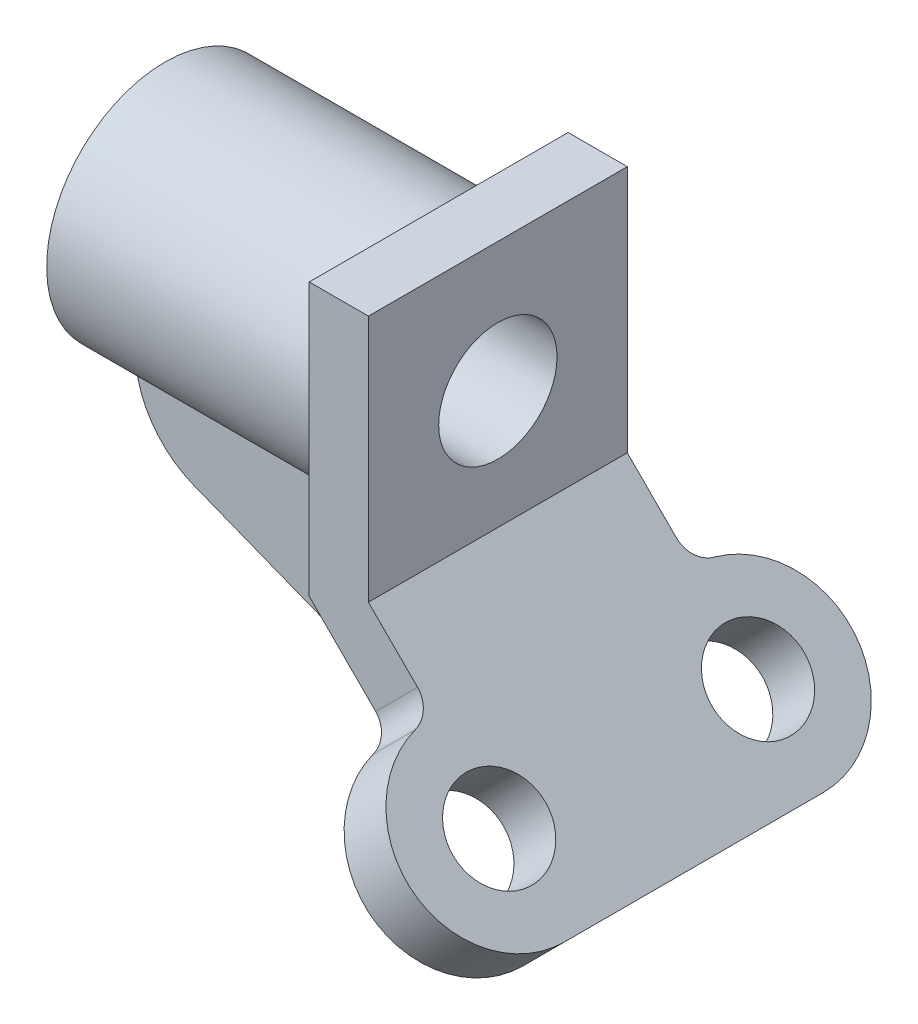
ISO-10303-21;
HEADER;
FILE_DESCRIPTION(('STEP AP214'),'2;1');
FILE_NAME('part.step','',(''),(''),'','','');
FILE_SCHEMA(('AUTOMOTIVE_DESIGN { 1 0 10303 214 1 1 1 1 }'));
ENDSEC;
DATA;
#1=APPLICATION_CONTEXT('core data for automotive mechanical design processes');
#2=APPLICATION_PROTOCOL_DEFINITION('international standard','automotive_design',2000,#1);
#3=PRODUCT_CONTEXT('',#1,'mechanical');
#4=PRODUCT('Part','Part','',(#3));
#5=PRODUCT_RELATED_PRODUCT_CATEGORY('part','',(#4));
#6=PRODUCT_DEFINITION_FORMATION('','',#4);
#7=PRODUCT_DEFINITION_CONTEXT('part definition',#1,'design');
#8=PRODUCT_DEFINITION('design','',#6,#7);
#9=PRODUCT_DEFINITION_SHAPE('','',#8);
#10=(LENGTH_UNIT() NAMED_UNIT(*) SI_UNIT(.MILLI.,.METRE.));
#11=(NAMED_UNIT(*) PLANE_ANGLE_UNIT() SI_UNIT($,.RADIAN.));
#12=(NAMED_UNIT(*) SI_UNIT($,.STERADIAN.) SOLID_ANGLE_UNIT());
#13=UNCERTAINTY_MEASURE_WITH_UNIT(LENGTH_MEASURE(1.E-05),#10,'distance_accuracy_value','');
#14=(GEOMETRIC_REPRESENTATION_CONTEXT(3) GLOBAL_UNCERTAINTY_ASSIGNED_CONTEXT((#13)) GLOBAL_UNIT_ASSIGNED_CONTEXT((#10,
#11,#12)) REPRESENTATION_CONTEXT('',''));
#15=CARTESIAN_POINT('',(0.,0.,0.));
#16=DIRECTION('',(0.,0.,1.));
#17=DIRECTION('',(1.,0.,0.));
#18=AXIS2_PLACEMENT_3D('',#15,#16,#17);
#19=CARTESIAN_POINT('',(-11.3137084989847,-11.3137084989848,35.));
#20=DIRECTION('',(0.707106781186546,0.707106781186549,0.));
#21=DIRECTION('',(-0.707106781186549,0.707106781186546,0.));
#22=AXIS2_PLACEMENT_3D('',#19,#20,#21);
#23=PLANE('',#22);
#24=CARTESIAN_POINT('',(24.0416305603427,-46.6690475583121,-35.));
#25=DIRECTION('',(0.707106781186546,0.707106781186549,0.));
#26=DIRECTION('',(-0.707106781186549,0.707106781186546,0.));
#27=AXIS2_PLACEMENT_3D('',#24,#25,#26);
#28=CIRCLE('',#27,12.5);
#29=CARTESIAN_POINT('',(15.2027957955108,-37.8302127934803,-35.));
#30=VERTEX_POINT('',#29);
#31=EDGE_CURVE('E214',#30,#30,#28,.F.);
#32=ORIENTED_EDGE('',*,*,#31,.F.);
#33=EDGE_LOOP('',(#32));
#34=FACE_BOUND('',#33,.T.);
#35=DIRECTION('',(-0.707106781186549,0.707106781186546,0.));
#36=VECTOR('',#35,1.);
#37=CARTESIAN_POINT('',(-16.,-6.62741699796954,-8.));
#38=LINE('',#37,#36);
#39=CARTESIAN_POINT('',(41.7193000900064,-64.3467170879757,-8.));
#40=VERTEX_POINT('',#39);
#41=CARTESIAN_POINT('',(-16.,-6.62741699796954,-8.));
#42=VERTEX_POINT('',#41);
#43=EDGE_CURVE('E179',#40,#42,#38,.T.);
#44=ORIENTED_EDGE('',*,*,#43,.T.);
#45=DIRECTION('',(0.,0.,-1.));
#46=VECTOR('',#45,1.);
#47=CARTESIAN_POINT('',(-16.,-6.62741699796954,35.));
#48=LINE('',#47,#46);
#49=CARTESIAN_POINT('',(-16.,-6.62741699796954,-35.));
#50=VERTEX_POINT('',#49);
#51=EDGE_CURVE('E265',#42,#50,#48,.T.);
#52=ORIENTED_EDGE('',*,*,#51,.T.);
#53=DIRECTION('',(0.707106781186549,-0.707106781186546,0.));
#54=VECTOR('',#53,1.);
#55=CARTESIAN_POINT('',(-11.3137084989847,-11.3137084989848,-35.));
#56=LINE('',#55,#54);
#57=CARTESIAN_POINT('',(1.96222839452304,-24.5896453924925,-35.));
#58=VERTEX_POINT('',#57);
#59=EDGE_CURVE('E232',#50,#58,#56,.T.);
#60=ORIENTED_EDGE('',*,*,#59,.T.);
#61=CARTESIAN_POINT('',(1.96222839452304,-24.5896453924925,-42.));
#62=DIRECTION('',(0.707106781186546,0.707106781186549,0.));
#63=DIRECTION('',(-0.707106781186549,0.707106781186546,0.));
#64=AXIS2_PLACEMENT_3D('',#61,#62,#63);
#65=CIRCLE('',#64,7.);
#66=CARTESIAN_POINT('',(6.79209761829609,-29.4195146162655,-40.46875));
#67=VERTEX_POINT('',#66);
#68=EDGE_CURVE('E293',#58,#67,#65,.T.);
#69=ORIENTED_EDGE('',*,*,#68,.T.);
#70=CARTESIAN_POINT('',(24.0416305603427,-46.6690475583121,-35.));
#71=DIRECTION('',(0.707106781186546,0.707106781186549,0.));
#72=DIRECTION('',(-0.707106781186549,0.707106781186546,0.));
#73=AXIS2_PLACEMENT_3D('',#70,#71,#72);
#74=CIRCLE('',#73,25.);
#75=CARTESIAN_POINT('',(41.7193000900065,-64.3467170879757,-35.));
#76=VERTEX_POINT('',#75);
#77=EDGE_CURVE('E219',#76,#67,#74,.T.);
#78=ORIENTED_EDGE('',*,*,#77,.F.);
#79=DIRECTION('',(0.,0.,-1.));
#80=VECTOR('',#79,1.);
#81=CARTESIAN_POINT('',(41.7193000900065,-64.3467170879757,35.));
#82=LINE('',#81,#80);
#83=EDGE_CURVE('E278',#40,#76,#82,.T.);
#84=ORIENTED_EDGE('',*,*,#83,.F.);
#85=EDGE_LOOP('',(#44,#52,#60,#69,#78,#84));
#86=FACE_BOUND('',#85,.T.);
#87=ADVANCED_FACE('F28',(#34,#86),#23,.F.);
#88=CARTESIAN_POINT('',(24.0416305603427,-46.6690475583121,35.));
#89=DIRECTION('',(0.707106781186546,0.707106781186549,0.));
#90=DIRECTION('',(-0.707106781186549,0.707106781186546,0.));
#91=AXIS2_PLACEMENT_3D('',#88,#89,#90);
#92=CIRCLE('',#91,12.5);
#93=CARTESIAN_POINT('',(15.2027957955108,-37.8302127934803,35.));
#94=VERTEX_POINT('',#93);
#95=EDGE_CURVE('E225',#94,#94,#92,.T.);
#96=ORIENTED_EDGE('',*,*,#95,.T.);
#97=EDGE_LOOP('',(#96));
#98=FACE_BOUND('',#97,.T.);
#99=CARTESIAN_POINT('',(-16.,-6.62741699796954,35.));
#100=VERTEX_POINT('',#99);
#101=CARTESIAN_POINT('',(-16.,-6.62741699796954,8.));
#102=VERTEX_POINT('',#101);
#103=EDGE_CURVE('E266',#100,#102,#48,.T.);
#104=ORIENTED_EDGE('',*,*,#103,.T.);
#105=DIRECTION('',(-0.707106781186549,0.707106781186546,0.));
#106=VECTOR('',#105,1.);
#107=CARTESIAN_POINT('',(-16.,-6.62741699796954,8.));
#108=LINE('',#107,#106);
#109=CARTESIAN_POINT('',(41.7193000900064,-64.3467170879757,8.));
#110=VERTEX_POINT('',#109);
#111=EDGE_CURVE('E192',#110,#102,#108,.T.);
#112=ORIENTED_EDGE('',*,*,#111,.F.);
#113=CARTESIAN_POINT('',(41.7193000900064,-64.3467170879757,35.));
#114=VERTEX_POINT('',#113);
#115=EDGE_CURVE('E279',#114,#110,#82,.T.);
#116=ORIENTED_EDGE('',*,*,#115,.F.);
#117=CARTESIAN_POINT('',(24.0416305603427,-46.6690475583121,35.));
#118=DIRECTION('',(0.707106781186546,0.707106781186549,0.));
#119=DIRECTION('',(-0.707106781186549,0.707106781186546,0.));
#120=AXIS2_PLACEMENT_3D('',#117,#118,#119);
#121=CIRCLE('',#120,25.);
#122=CARTESIAN_POINT('',(6.79209761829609,-29.4195146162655,40.46875));
#123=VERTEX_POINT('',#122);
#124=EDGE_CURVE('E230',#114,#123,#121,.F.);
#125=ORIENTED_EDGE('',*,*,#124,.T.);
#126=CARTESIAN_POINT('',(1.96222839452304,-24.5896453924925,42.));
#127=DIRECTION('',(0.707106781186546,0.707106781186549,0.));
#128=DIRECTION('',(-0.707106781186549,0.707106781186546,0.));
#129=AXIS2_PLACEMENT_3D('',#126,#127,#128);
#130=CIRCLE('',#129,7.);
#131=CARTESIAN_POINT('',(1.96222839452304,-24.5896453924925,35.));
#132=VERTEX_POINT('',#131);
#133=EDGE_CURVE('E11',#123,#132,#130,.T.);
#134=ORIENTED_EDGE('',*,*,#133,.T.);
#135=DIRECTION('',(0.707106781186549,-0.707106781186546,0.));
#136=VECTOR('',#135,1.);
#137=CARTESIAN_POINT('',(-11.3137084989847,-11.3137084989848,35.));
#138=LINE('',#137,#136);
#139=EDGE_CURVE('E250',#100,#132,#138,.T.);
#140=ORIENTED_EDGE('',*,*,#139,.F.);
#141=EDGE_LOOP('',(#104,#112,#116,#125,#134,#140));
#142=FACE_BOUND('',#141,.T.);
#143=ADVANCED_FACE('F30',(#98,#142),#23,.F.);
#144=CARTESIAN_POINT('',(0.,0.,35.));
#145=DIRECTION('',(0.707106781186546,0.707106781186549,0.));
#146=DIRECTION('',(-0.707106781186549,0.707106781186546,0.));
#147=AXIS2_PLACEMENT_3D('',#144,#145,#146);
#148=PLANE('',#147);
#149=CARTESIAN_POINT('',(35.3553390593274,-35.3553390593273,35.));
#150=DIRECTION('',(0.707106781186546,0.707106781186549,0.));
#151=DIRECTION('',(-0.707106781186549,0.707106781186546,0.));
#152=AXIS2_PLACEMENT_3D('',#149,#150,#151);
#153=CIRCLE('',#152,12.5);
#154=CARTESIAN_POINT('',(26.5165042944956,-26.5165042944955,35.));
#155=VERTEX_POINT('',#154);
#156=EDGE_CURVE('E222',#155,#155,#153,.T.);
#157=ORIENTED_EDGE('',*,*,#156,.F.);
#158=EDGE_LOOP('',(#157));
#159=FACE_BOUND('',#158,.T.);
#160=CARTESIAN_POINT('',(35.3553390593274,-35.3553390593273,-35.));
#161=DIRECTION('',(-0.707106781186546,-0.707106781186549,0.));
#162=DIRECTION('',(-0.707106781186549,0.707106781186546,0.));
#163=AXIS2_PLACEMENT_3D('',#160,#161,#162);
#164=CIRCLE('',#163,25.);
#165=CARTESIAN_POINT('',(18.1058061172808,-18.1058061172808,-40.46875));
#166=VERTEX_POINT('',#165);
#167=CARTESIAN_POINT('',(53.0330085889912,-53.033008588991,-35.));
#168=VERTEX_POINT('',#167);
#169=EDGE_CURVE('E217',#166,#168,#164,.T.);
#170=ORIENTED_EDGE('',*,*,#169,.F.);
#171=CARTESIAN_POINT('',(13.2759368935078,-13.2759368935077,-42.));
#172=DIRECTION('',(0.707106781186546,0.707106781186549,0.));
#173=DIRECTION('',(-0.707106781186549,0.707106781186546,0.));
#174=AXIS2_PLACEMENT_3D('',#171,#172,#173);
#175=CIRCLE('',#174,7.);
#176=CARTESIAN_POINT('',(13.2759368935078,-13.2759368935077,-35.));
#177=VERTEX_POINT('',#176);
#178=EDGE_CURVE('E295',#166,#177,#175,.F.);
#179=ORIENTED_EDGE('',*,*,#178,.T.);
#180=DIRECTION('',(0.707106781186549,-0.707106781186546,0.));
#181=VECTOR('',#180,1.);
#182=CARTESIAN_POINT('',(0.,0.,-35.));
#183=LINE('',#182,#181);
#184=CARTESIAN_POINT('',(0.,0.,-35.));
#185=VERTEX_POINT('',#184);
#186=EDGE_CURVE('E238',#185,#177,#183,.T.);
#187=ORIENTED_EDGE('',*,*,#186,.F.);
#188=DIRECTION('',(0.,0.,-1.));
#189=VECTOR('',#188,1.);
#190=CARTESIAN_POINT('',(0.,0.,35.));
#191=LINE('',#190,#189);
#192=CARTESIAN_POINT('',(0.,0.,35.));
#193=VERTEX_POINT('',#192);
#194=EDGE_CURVE('E273',#193,#185,#191,.T.);
#195=ORIENTED_EDGE('',*,*,#194,.F.);
#196=DIRECTION('',(0.707106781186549,-0.707106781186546,0.));
#197=VECTOR('',#196,1.);
#198=CARTESIAN_POINT('',(0.,0.,35.));
#199=LINE('',#198,#197);
#200=CARTESIAN_POINT('',(13.2759368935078,-13.2759368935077,35.));
#201=VERTEX_POINT('',#200);
#202=EDGE_CURVE('E255',#193,#201,#199,.T.);
#203=ORIENTED_EDGE('',*,*,#202,.T.);
#204=CARTESIAN_POINT('',(13.2759368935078,-13.2759368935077,42.));
#205=DIRECTION('',(0.707106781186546,0.707106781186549,0.));
#206=DIRECTION('',(-0.707106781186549,0.707106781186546,0.));
#207=AXIS2_PLACEMENT_3D('',#204,#205,#206);
#208=CIRCLE('',#207,7.);
#209=CARTESIAN_POINT('',(18.1058061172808,-18.1058061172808,40.46875));
#210=VERTEX_POINT('',#209);
#211=EDGE_CURVE('E36',#201,#210,#208,.F.);
#212=ORIENTED_EDGE('',*,*,#211,.T.);
#213=CARTESIAN_POINT('',(35.3553390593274,-35.3553390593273,35.));
#214=DIRECTION('',(0.707106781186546,0.707106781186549,0.));
#215=DIRECTION('',(-0.707106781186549,0.707106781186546,0.));
#216=AXIS2_PLACEMENT_3D('',#213,#214,#215);
#217=CIRCLE('',#216,25.);
#218=CARTESIAN_POINT('',(53.0330085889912,-53.033008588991,35.));
#219=VERTEX_POINT('',#218);
#220=EDGE_CURVE('E228',#210,#219,#217,.T.);
#221=ORIENTED_EDGE('',*,*,#220,.T.);
#222=DIRECTION('',(0.,0.,-1.));
#223=VECTOR('',#222,1.);
#224=CARTESIAN_POINT('',(53.0330085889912,-53.033008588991,35.));
#225=LINE('',#224,#223);
#226=EDGE_CURVE('E275',#219,#168,#225,.T.);
#227=ORIENTED_EDGE('',*,*,#226,.T.);
#228=EDGE_LOOP('',(#170,#179,#187,#195,#203,#212,#221,#227));
#229=FACE_BOUND('',#228,.T.);
#230=CARTESIAN_POINT('',(35.3553390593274,-35.3553390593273,-35.));
#231=DIRECTION('',(-0.707106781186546,-0.707106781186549,0.));
#232=DIRECTION('',(-0.707106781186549,0.707106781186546,0.));
#233=AXIS2_PLACEMENT_3D('',#230,#231,#232);
#234=CIRCLE('',#233,12.5);
#235=CARTESIAN_POINT('',(26.5165042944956,-26.5165042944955,-35.));
#236=VERTEX_POINT('',#235);
#237=EDGE_CURVE('E211',#236,#236,#234,.T.);
#238=ORIENTED_EDGE('',*,*,#237,.T.);
#239=EDGE_LOOP('',(#238));
#240=FACE_BOUND('',#239,.T.);
#241=ADVANCED_FACE('F299',(#159,#229,#240),#148,.T.);
#242=CARTESIAN_POINT('',(41.7193000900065,-64.3467170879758,-35.));
#243=DIRECTION('',(0.,0.,-1.));
#244=DIRECTION('',(-1.,0.,0.));
#245=AXIS2_PLACEMENT_3D('',#242,#243,#244);
#246=PLANE('',#245);
#247=ORIENTED_EDGE('',*,*,#186,.T.);
#248=DIRECTION('',(0.707106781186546,0.707106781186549,0.));
#249=VECTOR('',#248,1.);
#250=CARTESIAN_POINT('',(1.96222839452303,-24.5896453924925,-35.));
#251=LINE('',#250,#249);
#252=EDGE_CURVE('E282',#177,#58,#251,.F.);
#253=ORIENTED_EDGE('',*,*,#252,.T.);
#254=ORIENTED_EDGE('',*,*,#59,.F.);
#255=DIRECTION('',(0.,1.,0.));
#256=VECTOR('',#255,1.);
#257=CARTESIAN_POINT('',(-16.,0.,-35.));
#258=LINE('',#257,#256);
#259=CARTESIAN_POINT('',(-16.,67.,-35.));
#260=VERTEX_POINT('',#259);
#261=EDGE_CURVE('E247',#260,#50,#258,.F.);
#262=ORIENTED_EDGE('',*,*,#261,.F.);
#263=DIRECTION('',(1.,0.,0.));
#264=VECTOR('',#263,1.);
#265=CARTESIAN_POINT('',(-16.,67.,-35.));
#266=LINE('',#265,#264);
#267=CARTESIAN_POINT('',(0.,67.,-35.));
#268=VERTEX_POINT('',#267);
#269=EDGE_CURVE('E244',#260,#268,#266,.T.);
#270=ORIENTED_EDGE('',*,*,#269,.T.);
#271=DIRECTION('',(0.,-1.,0.));
#272=VECTOR('',#271,1.);
#273=CARTESIAN_POINT('',(0.,0.,-35.));
#274=LINE('',#273,#272);
#275=EDGE_CURVE('E241',#268,#185,#274,.T.);
#276=ORIENTED_EDGE('',*,*,#275,.T.);
#277=EDGE_LOOP('',(#247,#253,#254,#262,#270,#276));
#278=FACE_BOUND('',#277,.T.);
#279=ADVANCED_FACE('F305',(#278),#246,.T.);
#280=CARTESIAN_POINT('',(53.0330085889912,-53.033008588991,35.));
#281=DIRECTION('',(0.70710678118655,-0.707106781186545,0.));
#282=DIRECTION('',(0.707106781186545,0.70710678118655,0.));
#283=AXIS2_PLACEMENT_3D('',#280,#281,#282);
#284=PLANE('',#283);
#285=DIRECTION('',(-0.707106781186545,-0.70710678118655,0.));
#286=VECTOR('',#285,1.);
#287=CARTESIAN_POINT('',(53.0330085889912,-53.033008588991,-35.));
#288=LINE('',#287,#286);
#289=EDGE_CURVE('E235',#168,#76,#288,.T.);
#290=ORIENTED_EDGE('',*,*,#289,.F.);
#291=ORIENTED_EDGE('',*,*,#226,.F.);
#292=DIRECTION('',(-0.707106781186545,-0.70710678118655,0.));
#293=VECTOR('',#292,1.);
#294=CARTESIAN_POINT('',(53.0330085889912,-53.033008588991,35.));
#295=LINE('',#294,#293);
#296=EDGE_CURVE('E253',#219,#114,#295,.T.);
#297=ORIENTED_EDGE('',*,*,#296,.T.);
#298=ORIENTED_EDGE('',*,*,#115,.T.);
#299=DIRECTION('',(0.,0.,-1.));
#300=VECTOR('',#299,1.);
#301=CARTESIAN_POINT('',(41.7193000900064,-64.3467170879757,8.));
#302=LINE('',#301,#300);
#303=EDGE_CURVE('E199',#110,#40,#302,.T.);
#304=ORIENTED_EDGE('',*,*,#303,.T.);
#305=ORIENTED_EDGE('',*,*,#83,.T.);
#306=EDGE_LOOP('',(#290,#291,#297,#298,#304,#305));
#307=FACE_BOUND('',#306,.T.);
#308=ADVANCED_FACE('F317',(#307),#284,.T.);
#309=CARTESIAN_POINT('',(0.,0.,35.));
#310=DIRECTION('',(1.,0.,0.));
#311=DIRECTION('',(0.,0.,-1.));
#312=AXIS2_PLACEMENT_3D('',#309,#310,#311);
#313=PLANE('',#312);
#314=CARTESIAN_POINT('',(0.,32.,0.));
#315=DIRECTION('',(1.,0.,0.));
#316=DIRECTION('',(0.,0.,-1.));
#317=AXIS2_PLACEMENT_3D('',#314,#315,#316);
#318=CIRCLE('',#317,16.);
#319=CARTESIAN_POINT('',(0.,32.,-16.));
#320=VERTEX_POINT('',#319);
#321=EDGE_CURVE('E171',#320,#320,#318,.T.);
#322=ORIENTED_EDGE('',*,*,#321,.F.);
#323=EDGE_LOOP('',(#322));
#324=FACE_BOUND('',#323,.T.);
#325=ORIENTED_EDGE('',*,*,#194,.T.);
#326=ORIENTED_EDGE('',*,*,#275,.F.);
#327=DIRECTION('',(0.,0.,-1.));
#328=VECTOR('',#327,1.);
#329=CARTESIAN_POINT('',(0.,67.,35.));
#330=LINE('',#329,#328);
#331=CARTESIAN_POINT('',(0.,67.,35.));
#332=VERTEX_POINT('',#331);
#333=EDGE_CURVE('E271',#332,#268,#330,.T.);
#334=ORIENTED_EDGE('',*,*,#333,.F.);
#335=DIRECTION('',(0.,-1.,0.));
#336=VECTOR('',#335,1.);
#337=CARTESIAN_POINT('',(0.,0.,35.));
#338=LINE('',#337,#336);
#339=EDGE_CURVE('E257',#332,#193,#338,.T.);
#340=ORIENTED_EDGE('',*,*,#339,.T.);
#341=EDGE_LOOP('',(#325,#326,#334,#340));
#342=FACE_BOUND('',#341,.T.);
#343=ADVANCED_FACE('F332',(#324,#342),#313,.T.);
#344=CARTESIAN_POINT('',(-16.,67.,35.));
#345=DIRECTION('',(0.,1.,0.));
#346=DIRECTION('',(0.,0.,1.));
#347=AXIS2_PLACEMENT_3D('',#344,#345,#346);
#348=PLANE('',#347);
#349=ORIENTED_EDGE('',*,*,#269,.F.);
#350=DIRECTION('',(0.,0.,-1.));
#351=VECTOR('',#350,1.);
#352=CARTESIAN_POINT('',(-16.,67.,35.));
#353=LINE('',#352,#351);
#354=CARTESIAN_POINT('',(-16.,67.,35.));
#355=VERTEX_POINT('',#354);
#356=EDGE_CURVE('E269',#355,#260,#353,.T.);
#357=ORIENTED_EDGE('',*,*,#356,.F.);
#358=DIRECTION('',(1.,0.,0.));
#359=VECTOR('',#358,1.);
#360=CARTESIAN_POINT('',(-16.,67.,35.));
#361=LINE('',#360,#359);
#362=EDGE_CURVE('E260',#355,#332,#361,.T.);
#363=ORIENTED_EDGE('',*,*,#362,.T.);
#364=ORIENTED_EDGE('',*,*,#333,.T.);
#365=EDGE_LOOP('',(#349,#357,#363,#364));
#366=FACE_BOUND('',#365,.T.);
#367=ADVANCED_FACE('F328',(#366),#348,.T.);
#368=CARTESIAN_POINT('',(-16.,0.,35.));
#369=DIRECTION('',(1.,0.,0.));
#370=DIRECTION('',(0.,0.,-1.));
#371=AXIS2_PLACEMENT_3D('',#368,#369,#370);
#372=PLANE('',#371);
#373=CARTESIAN_POINT('',(-16.,32.,0.));
#374=DIRECTION('',(1.,0.,0.));
#375=DIRECTION('',(0.,0.,-1.));
#376=AXIS2_PLACEMENT_3D('',#373,#374,#375);
#377=CIRCLE('',#376,32.);
#378=CARTESIAN_POINT('',(-16.,1.01613323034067,-8.));
#379=VERTEX_POINT('',#378);
#380=CARTESIAN_POINT('',(-16.,1.01613323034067,8.));
#381=VERTEX_POINT('',#380);
#382=EDGE_CURVE('E210',#379,#381,#377,.T.);
#383=ORIENTED_EDGE('',*,*,#382,.T.);
#384=DIRECTION('',(0.,1.,0.));
#385=VECTOR('',#384,1.);
#386=CARTESIAN_POINT('',(-16.,32.,8.));
#387=LINE('',#386,#385);
#388=EDGE_CURVE('E194',#102,#381,#387,.T.);
#389=ORIENTED_EDGE('',*,*,#388,.F.);
#390=ORIENTED_EDGE('',*,*,#103,.F.);
#391=DIRECTION('',(0.,1.,0.));
#392=VECTOR('',#391,1.);
#393=CARTESIAN_POINT('',(-16.,0.,35.));
#394=LINE('',#393,#392);
#395=EDGE_CURVE('E263',#355,#100,#394,.F.);
#396=ORIENTED_EDGE('',*,*,#395,.F.);
#397=ORIENTED_EDGE('',*,*,#356,.T.);
#398=ORIENTED_EDGE('',*,*,#261,.T.);
#399=ORIENTED_EDGE('',*,*,#51,.F.);
#400=DIRECTION('',(0.,1.,0.));
#401=VECTOR('',#400,1.);
#402=CARTESIAN_POINT('',(-16.,32.,-8.));
#403=LINE('',#402,#401);
#404=EDGE_CURVE('E182',#42,#379,#403,.T.);
#405=ORIENTED_EDGE('',*,*,#404,.T.);
#406=EDGE_LOOP('',(#383,#389,#390,#396,#397,#398,#399,#405));
#407=FACE_BOUND('',#406,.T.);
#408=ADVANCED_FACE('F322',(#407),#372,.F.);
#409=CARTESIAN_POINT('',(41.7193000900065,-64.3467170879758,35.));
#410=DIRECTION('',(0.,0.,-1.));
#411=DIRECTION('',(-1.,0.,0.));
#412=AXIS2_PLACEMENT_3D('',#409,#410,#411);
#413=PLANE('',#412);
#414=ORIENTED_EDGE('',*,*,#139,.T.);
#415=DIRECTION('',(0.707106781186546,0.707106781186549,0.));
#416=VECTOR('',#415,1.);
#417=CARTESIAN_POINT('',(1.96222839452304,-24.5896453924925,35.));
#418=LINE('',#417,#416);
#419=EDGE_CURVE('E289',#132,#201,#418,.T.);
#420=ORIENTED_EDGE('',*,*,#419,.T.);
#421=ORIENTED_EDGE('',*,*,#202,.F.);
#422=ORIENTED_EDGE('',*,*,#339,.F.);
#423=ORIENTED_EDGE('',*,*,#362,.F.);
#424=ORIENTED_EDGE('',*,*,#395,.T.);
#425=EDGE_LOOP('',(#414,#420,#421,#422,#423,#424));
#426=FACE_BOUND('',#425,.T.);
#427=ADVANCED_FACE('F335',(#426),#413,.F.);
#428=CARTESIAN_POINT('',(-25.9583694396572,-96.6690475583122,35.));
#429=DIRECTION('',(0.707106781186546,0.707106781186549,0.));
#430=DIRECTION('',(-0.707106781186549,0.707106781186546,0.));
#431=AXIS2_PLACEMENT_3D('',#428,#429,#430);
#432=CYLINDRICAL_SURFACE('',#431,25.);
#433=ORIENTED_EDGE('',*,*,#220,.F.);
#434=DIRECTION('',(0.707106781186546,0.707106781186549,0.));
#435=VECTOR('',#434,1.);
#436=CARTESIAN_POINT('',(-43.2079023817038,-79.4195146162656,40.46875));
#437=LINE('',#436,#435);
#438=EDGE_CURVE('E49',#210,#123,#437,.F.);
#439=ORIENTED_EDGE('',*,*,#438,.T.);
#440=ORIENTED_EDGE('',*,*,#124,.F.);
#441=ORIENTED_EDGE('',*,*,#296,.F.);
#442=EDGE_LOOP('',(#433,#439,#440,#441));
#443=FACE_BOUND('',#442,.T.);
#444=ADVANCED_FACE('F344',(#443),#432,.T.);
#445=CARTESIAN_POINT('',(-4.8180194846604,-75.5286976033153,35.));
#446=DIRECTION('',(0.707106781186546,0.707106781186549,0.));
#447=DIRECTION('',(-0.707106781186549,0.707106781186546,0.));
#448=AXIS2_PLACEMENT_3D('',#445,#446,#447);
#449=CYLINDRICAL_SURFACE('',#448,12.5);
#450=CARTESIAN_POINT('',(26.5165042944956,-26.5165042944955,35.));
#451=CARTESIAN_POINT('',(26.3986531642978,-26.6343554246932,35.));
#452=CARTESIAN_POINT('',(26.2808020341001,-26.752206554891,35.));
#453=CARTESIAN_POINT('',(26.0450997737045,-26.9879088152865,35.));
#454=CARTESIAN_POINT('',(25.9272486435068,-27.1057599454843,35.));
#455=CARTESIAN_POINT('',(25.6915463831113,-27.3414622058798,35.));
#456=CARTESIAN_POINT('',(25.5736952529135,-27.4593133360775,35.));
#457=CARTESIAN_POINT('',(25.337992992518,-27.6950155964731,35.));
#458=CARTESIAN_POINT('',(25.2201418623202,-27.8128667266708,35.));
#459=CARTESIAN_POINT('',(24.9844396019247,-28.0485689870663,35.));
#460=CARTESIAN_POINT('',(24.866588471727,-28.1664201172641,35.));
#461=CARTESIAN_POINT('',(24.6308862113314,-28.4021223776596,35.));
#462=CARTESIAN_POINT('',(24.5130350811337,-28.5199735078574,35.));
#463=CARTESIAN_POINT('',(24.2773328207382,-28.7556757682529,35.));
#464=CARTESIAN_POINT('',(24.1594816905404,-28.8735268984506,35.));
#465=CARTESIAN_POINT('',(23.9237794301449,-29.1092291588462,35.));
#466=CARTESIAN_POINT('',(23.8059282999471,-29.2270802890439,35.));
#467=CARTESIAN_POINT('',(23.5702260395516,-29.4627825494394,35.));
#468=CARTESIAN_POINT('',(23.4523749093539,-29.5806336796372,35.));
#469=CARTESIAN_POINT('',(23.2166726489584,-29.8163359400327,35.));
#470=CARTESIAN_POINT('',(23.0988215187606,-29.9341870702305,35.));
#471=CARTESIAN_POINT('',(22.8631192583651,-30.169889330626,35.));
#472=CARTESIAN_POINT('',(22.7452681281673,-30.2877404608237,35.));
#473=CARTESIAN_POINT('',(22.5095658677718,-30.5234427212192,35.));
#474=CARTESIAN_POINT('',(22.3917147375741,-30.641293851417,35.));
#475=CARTESIAN_POINT('',(22.1560124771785,-30.8769961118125,35.));
#476=CARTESIAN_POINT('',(22.0381613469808,-30.9948472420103,35.));
#477=CARTESIAN_POINT('',(21.8024590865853,-31.2305495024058,35.));
#478=CARTESIAN_POINT('',(21.6846079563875,-31.3484006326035,35.));
#479=CARTESIAN_POINT('',(21.448905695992,-31.5841028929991,35.));
#480=CARTESIAN_POINT('',(21.3310545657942,-31.7019540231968,35.));
#481=CARTESIAN_POINT('',(21.0953523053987,-31.9376562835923,35.));
#482=CARTESIAN_POINT('',(20.977501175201,-32.0555074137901,35.));
#483=CARTESIAN_POINT('',(20.7417989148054,-32.2912096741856,35.));
#484=CARTESIAN_POINT('',(20.6239477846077,-32.4090608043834,35.));
#485=CARTESIAN_POINT('',(20.3882455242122,-32.6447630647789,35.));
#486=CARTESIAN_POINT('',(20.2703943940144,-32.7626141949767,35.));
#487=CARTESIAN_POINT('',(20.0346921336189,-32.9983164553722,35.));
#488=CARTESIAN_POINT('',(19.9168410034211,-33.1161675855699,35.));
#489=CARTESIAN_POINT('',(19.6811387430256,-33.3518698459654,35.));
#490=CARTESIAN_POINT('',(19.5632876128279,-33.4697209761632,35.));
#491=CARTESIAN_POINT('',(19.3275853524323,-33.7054232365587,35.));
#492=CARTESIAN_POINT('',(19.2097342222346,-33.8232743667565,35.));
#493=CARTESIAN_POINT('',(18.9740319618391,-34.058976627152,35.));
#494=CARTESIAN_POINT('',(18.8561808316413,-34.1768277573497,35.));
#495=CARTESIAN_POINT('',(18.6204785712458,-34.4125300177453,35.));
#496=CARTESIAN_POINT('',(18.502627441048,-34.530381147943,35.));
#497=CARTESIAN_POINT('',(18.2669251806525,-34.7660834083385,35.));
#498=CARTESIAN_POINT('',(18.1490740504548,-34.8839345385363,35.));
#499=CARTESIAN_POINT('',(17.9133717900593,-35.1196367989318,35.));
#500=CARTESIAN_POINT('',(17.7955206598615,-35.2374879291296,35.));
#501=CARTESIAN_POINT('',(17.559818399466,-35.4731901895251,35.));
#502=CARTESIAN_POINT('',(17.4419672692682,-35.5910413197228,35.));
#503=CARTESIAN_POINT('',(17.2062650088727,-35.8267435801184,35.));
#504=CARTESIAN_POINT('',(17.088413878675,-35.9445947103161,35.));
#505=CARTESIAN_POINT('',(16.8527116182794,-36.1802969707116,35.));
#506=CARTESIAN_POINT('',(16.7348604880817,-36.2981481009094,35.));
#507=CARTESIAN_POINT('',(16.4991582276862,-36.5338503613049,35.));
#508=CARTESIAN_POINT('',(16.3813070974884,-36.6517014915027,35.));
#509=CARTESIAN_POINT('',(16.1456048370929,-36.8874037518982,35.));
#510=CARTESIAN_POINT('',(16.0277537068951,-37.0052548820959,35.));
#511=CARTESIAN_POINT('',(15.7920514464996,-37.2409571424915,35.));
#512=CARTESIAN_POINT('',(15.6742003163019,-37.3588082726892,35.));
#513=CARTESIAN_POINT('',(15.4384980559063,-37.5945105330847,35.));
#514=CARTESIAN_POINT('',(15.3206469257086,-37.7123616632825,35.));
#515=CARTESIAN_POINT('',(15.2027957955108,-37.8302127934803,35.));
#516=B_SPLINE_CURVE_WITH_KNOTS('',3,(#450,#451,#452,#453,#454,#455,#456,#457,#458,#459,#460,
#461,#462,#463,#464,#465,#466,#467,#468,#469,#470,#471,#472,#473,#474,#475,#476,#477,#478,#479,
#480,#481,#482,#483,#484,#485,#486,#487,#488,#489,#490,#491,#492,#493,#494,#495,#496,#497,#498,
#499,#500,#501,#502,#503,#504,#505,#506,#507,#508,#509,#510,#511,#512,#513,#514,#515),
.UNSPECIFIED.,.F.,.F.,(4,2,2,2,2,2,2,2,2,2,2,2,2,2,2,2,2,2,2,2,2,2,2,2,2,2,2,2,2,2,2,2,4),(0.,
0.500000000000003,1.,1.5,2.,2.5,3.,3.50000000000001,4.00000000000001,4.5,5.,5.5,6.,6.5,7.,7.5,
8.,8.5,9.00000000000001,9.5,10.,10.5,11.,11.5,12.,12.5,13.,13.5,14.,14.5,15.,15.5,16.),.UNSPECIFIED.);
#517=EDGE_CURVE('BSEAM346',#155,#94,#516,.T.);
#518=ORIENTED_EDGE('',*,*,#156,.T.);
#519=ORIENTED_EDGE('',*,*,#95,.F.);
#520=ORIENTED_EDGE('',*,*,#517,.T.);
#521=ORIENTED_EDGE('',*,*,#517,.F.);
#522=EDGE_LOOP('',(#518,#520,#519,#521));
#523=FACE_BOUND('',#522,.T.);
#524=ADVANCED_FACE('F346',(#523),#449,.F.);
#525=CARTESIAN_POINT('',(-25.9583694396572,-96.6690475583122,-35.));
#526=DIRECTION('',(0.707106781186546,0.707106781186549,0.));
#527=DIRECTION('',(-0.707106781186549,0.707106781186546,0.));
#528=AXIS2_PLACEMENT_3D('',#525,#526,#527);
#529=CYLINDRICAL_SURFACE('',#528,25.);
#530=ORIENTED_EDGE('',*,*,#77,.T.);
#531=DIRECTION('',(0.707106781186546,0.707106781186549,0.));
#532=VECTOR('',#531,1.);
#533=CARTESIAN_POINT('',(-43.2079023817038,-79.4195146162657,-40.46875));
#534=LINE('',#533,#532);
#535=EDGE_CURVE('E287',#67,#166,#534,.T.);
#536=ORIENTED_EDGE('',*,*,#535,.T.);
#537=ORIENTED_EDGE('',*,*,#169,.T.);
#538=ORIENTED_EDGE('',*,*,#289,.T.);
#539=EDGE_LOOP('',(#530,#536,#537,#538));
#540=FACE_BOUND('',#539,.T.);
#541=ADVANCED_FACE('F313',(#540),#529,.T.);
#542=CARTESIAN_POINT('',(-4.8180194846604,-75.5286976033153,-35.));
#543=DIRECTION('',(0.707106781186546,0.707106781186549,0.));
#544=DIRECTION('',(-0.707106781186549,0.707106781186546,0.));
#545=AXIS2_PLACEMENT_3D('',#542,#543,#544);
#546=CYLINDRICAL_SURFACE('',#545,12.5);
#547=CARTESIAN_POINT('',(26.5165042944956,-26.5165042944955,-35.));
#548=CARTESIAN_POINT('',(26.3986531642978,-26.6343554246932,-35.));
#549=CARTESIAN_POINT('',(26.2808020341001,-26.752206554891,-35.));
#550=CARTESIAN_POINT('',(26.0450997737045,-26.9879088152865,-35.));
#551=CARTESIAN_POINT('',(25.9272486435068,-27.1057599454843,-35.));
#552=CARTESIAN_POINT('',(25.6915463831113,-27.3414622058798,-35.));
#553=CARTESIAN_POINT('',(25.5736952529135,-27.4593133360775,-35.));
#554=CARTESIAN_POINT('',(25.337992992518,-27.6950155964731,-35.));
#555=CARTESIAN_POINT('',(25.2201418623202,-27.8128667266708,-35.));
#556=CARTESIAN_POINT('',(24.9844396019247,-28.0485689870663,-35.));
#557=CARTESIAN_POINT('',(24.866588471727,-28.1664201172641,-35.));
#558=CARTESIAN_POINT('',(24.6308862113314,-28.4021223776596,-35.));
#559=CARTESIAN_POINT('',(24.5130350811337,-28.5199735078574,-35.));
#560=CARTESIAN_POINT('',(24.2773328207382,-28.7556757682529,-35.));
#561=CARTESIAN_POINT('',(24.1594816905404,-28.8735268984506,-35.));
#562=CARTESIAN_POINT('',(23.9237794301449,-29.1092291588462,-35.));
#563=CARTESIAN_POINT('',(23.8059282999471,-29.2270802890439,-35.));
#564=CARTESIAN_POINT('',(23.5702260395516,-29.4627825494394,-35.));
#565=CARTESIAN_POINT('',(23.4523749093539,-29.5806336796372,-35.));
#566=CARTESIAN_POINT('',(23.2166726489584,-29.8163359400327,-35.));
#567=CARTESIAN_POINT('',(23.0988215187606,-29.9341870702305,-35.));
#568=CARTESIAN_POINT('',(22.8631192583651,-30.169889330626,-35.));
#569=CARTESIAN_POINT('',(22.7452681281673,-30.2877404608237,-35.));
#570=CARTESIAN_POINT('',(22.5095658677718,-30.5234427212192,-35.));
#571=CARTESIAN_POINT('',(22.3917147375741,-30.641293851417,-35.));
#572=CARTESIAN_POINT('',(22.1560124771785,-30.8769961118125,-35.));
#573=CARTESIAN_POINT('',(22.0381613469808,-30.9948472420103,-35.));
#574=CARTESIAN_POINT('',(21.8024590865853,-31.2305495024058,-35.));
#575=CARTESIAN_POINT('',(21.6846079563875,-31.3484006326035,-35.));
#576=CARTESIAN_POINT('',(21.448905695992,-31.5841028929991,-35.));
#577=CARTESIAN_POINT('',(21.3310545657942,-31.7019540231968,-35.));
#578=CARTESIAN_POINT('',(21.0953523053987,-31.9376562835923,-35.));
#579=CARTESIAN_POINT('',(20.977501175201,-32.0555074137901,-35.));
#580=CARTESIAN_POINT('',(20.7417989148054,-32.2912096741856,-35.));
#581=CARTESIAN_POINT('',(20.6239477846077,-32.4090608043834,-35.));
#582=CARTESIAN_POINT('',(20.3882455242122,-32.6447630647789,-35.));
#583=CARTESIAN_POINT('',(20.2703943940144,-32.7626141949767,-35.));
#584=CARTESIAN_POINT('',(20.0346921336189,-32.9983164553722,-35.));
#585=CARTESIAN_POINT('',(19.9168410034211,-33.1161675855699,-35.));
#586=CARTESIAN_POINT('',(19.6811387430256,-33.3518698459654,-35.));
#587=CARTESIAN_POINT('',(19.5632876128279,-33.4697209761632,-35.));
#588=CARTESIAN_POINT('',(19.3275853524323,-33.7054232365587,-35.));
#589=CARTESIAN_POINT('',(19.2097342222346,-33.8232743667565,-35.));
#590=CARTESIAN_POINT('',(18.9740319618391,-34.058976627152,-35.));
#591=CARTESIAN_POINT('',(18.8561808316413,-34.1768277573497,-35.));
#592=CARTESIAN_POINT('',(18.6204785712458,-34.4125300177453,-35.));
#593=CARTESIAN_POINT('',(18.502627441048,-34.530381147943,-35.));
#594=CARTESIAN_POINT('',(18.2669251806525,-34.7660834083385,-35.));
#595=CARTESIAN_POINT('',(18.1490740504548,-34.8839345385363,-35.));
#596=CARTESIAN_POINT('',(17.9133717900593,-35.1196367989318,-35.));
#597=CARTESIAN_POINT('',(17.7955206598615,-35.2374879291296,-35.));
#598=CARTESIAN_POINT('',(17.559818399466,-35.4731901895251,-35.));
#599=CARTESIAN_POINT('',(17.4419672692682,-35.5910413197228,-35.));
#600=CARTESIAN_POINT('',(17.2062650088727,-35.8267435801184,-35.));
#601=CARTESIAN_POINT('',(17.088413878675,-35.9445947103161,-35.));
#602=CARTESIAN_POINT('',(16.8527116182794,-36.1802969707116,-35.));
#603=CARTESIAN_POINT('',(16.7348604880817,-36.2981481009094,-35.));
#604=CARTESIAN_POINT('',(16.4991582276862,-36.5338503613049,-35.));
#605=CARTESIAN_POINT('',(16.3813070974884,-36.6517014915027,-35.));
#606=CARTESIAN_POINT('',(16.1456048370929,-36.8874037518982,-35.));
#607=CARTESIAN_POINT('',(16.0277537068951,-37.0052548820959,-35.));
#608=CARTESIAN_POINT('',(15.7920514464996,-37.2409571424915,-35.));
#609=CARTESIAN_POINT('',(15.6742003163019,-37.3588082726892,-35.));
#610=CARTESIAN_POINT('',(15.4384980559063,-37.5945105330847,-35.));
#611=CARTESIAN_POINT('',(15.3206469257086,-37.7123616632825,-35.));
#612=CARTESIAN_POINT('',(15.2027957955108,-37.8302127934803,-35.));
#613=B_SPLINE_CURVE_WITH_KNOTS('',3,(#547,#548,#549,#550,#551,#552,#553,#554,#555,#556,#557,
#558,#559,#560,#561,#562,#563,#564,#565,#566,#567,#568,#569,#570,#571,#572,#573,#574,#575,#576,
#577,#578,#579,#580,#581,#582,#583,#584,#585,#586,#587,#588,#589,#590,#591,#592,#593,#594,#595,
#596,#597,#598,#599,#600,#601,#602,#603,#604,#605,#606,#607,#608,#609,#610,#611,#612),
.UNSPECIFIED.,.F.,.F.,(4,2,2,2,2,2,2,2,2,2,2,2,2,2,2,2,2,2,2,2,2,2,2,2,2,2,2,2,2,2,2,2,4),(0.,
0.500000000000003,1.,1.5,2.,2.5,3.,3.50000000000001,4.00000000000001,4.5,5.,5.5,6.,6.5,7.,7.5,
8.,8.5,9.00000000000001,9.5,10.,10.5,11.,11.5,12.,12.5,13.,13.5,14.,14.5,15.,15.5,16.),.UNSPECIFIED.);
#614=EDGE_CURVE('BSEAM366',#236,#30,#613,.T.);
#615=ORIENTED_EDGE('',*,*,#237,.F.);
#616=ORIENTED_EDGE('',*,*,#31,.T.);
#617=ORIENTED_EDGE('',*,*,#614,.T.);
#618=ORIENTED_EDGE('',*,*,#614,.F.);
#619=EDGE_LOOP('',(#615,#617,#616,#618));
#620=FACE_BOUND('',#619,.T.);
#621=ADVANCED_FACE('F366',(#620),#546,.F.);
#622=CARTESIAN_POINT('',(-90.,32.,0.));
#623=DIRECTION('',(1.,0.,0.));
#624=DIRECTION('',(0.,0.,-1.));
#625=AXIS2_PLACEMENT_3D('',#622,#623,#624);
#626=CYLINDRICAL_SURFACE('',#625,32.);
#627=DIRECTION('',(1.,0.,0.));
#628=VECTOR('',#627,1.);
#629=CARTESIAN_POINT('',(-90.,1.01613323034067,8.));
#630=LINE('',#629,#628);
#631=CARTESIAN_POINT('',(-90.,1.01613323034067,8.));
#632=VERTEX_POINT('',#631);
#633=EDGE_CURVE('E205',#381,#632,#630,.F.);
#634=ORIENTED_EDGE('',*,*,#633,.F.);
#635=ORIENTED_EDGE('',*,*,#382,.F.);
#636=DIRECTION('',(1.,0.,0.));
#637=VECTOR('',#636,1.);
#638=CARTESIAN_POINT('',(-90.,1.01613323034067,-8.));
#639=LINE('',#638,#637);
#640=CARTESIAN_POINT('',(-90.,1.01613323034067,-8.));
#641=VERTEX_POINT('',#640);
#642=EDGE_CURVE('E164',#379,#641,#639,.F.);
#643=ORIENTED_EDGE('',*,*,#642,.T.);
#644=CARTESIAN_POINT('',(-90.,32.,0.));
#645=DIRECTION('',(1.,0.,0.));
#646=DIRECTION('',(0.,0.,-1.));
#647=AXIS2_PLACEMENT_3D('',#644,#645,#646);
#648=CIRCLE('',#647,32.);
#649=EDGE_CURVE('E207',#641,#632,#648,.T.);
#650=ORIENTED_EDGE('',*,*,#649,.T.);
#651=EDGE_LOOP('',(#634,#635,#643,#650));
#652=FACE_BOUND('',#651,.T.);
#653=ADVANCED_FACE('F368',(#652),#626,.T.);
#654=CARTESIAN_POINT('',(-90.,32.,0.));
#655=DIRECTION('',(1.,0.,0.));
#656=DIRECTION('',(0.,0.,-1.));
#657=AXIS2_PLACEMENT_3D('',#654,#655,#656);
#658=PLANE('',#657);
#659=CARTESIAN_POINT('',(-90.,32.,0.));
#660=DIRECTION('',(-1.,0.,0.));
#661=DIRECTION('',(0.,0.,1.));
#662=AXIS2_PLACEMENT_3D('',#659,#660,#661);
#663=CIRCLE('',#662,16.);
#664=CARTESIAN_POINT('',(-90.,32.,16.));
#665=VERTEX_POINT('',#664);
#666=EDGE_CURVE('E174',#665,#665,#663,.T.);
#667=ORIENTED_EDGE('',*,*,#666,.F.);
#668=EDGE_LOOP('',(#667));
#669=FACE_BOUND('',#668,.T.);
#670=ORIENTED_EDGE('',*,*,#649,.F.);
#671=DIRECTION('',(0.,-1.,0.));
#672=VECTOR('',#671,1.);
#673=CARTESIAN_POINT('',(-90.,32.,-8.));
#674=LINE('',#673,#672);
#675=CARTESIAN_POINT('',(-90.,0.,-8.));
#676=VERTEX_POINT('',#675);
#677=EDGE_CURVE('E185',#641,#676,#674,.T.);
#678=ORIENTED_EDGE('',*,*,#677,.T.);
#679=DIRECTION('',(0.,0.,-1.));
#680=VECTOR('',#679,1.);
#681=CARTESIAN_POINT('',(-90.,0.,8.));
#682=LINE('',#681,#680);
#683=CARTESIAN_POINT('',(-90.,0.,8.));
#684=VERTEX_POINT('',#683);
#685=EDGE_CURVE('E169',#684,#676,#682,.T.);
#686=ORIENTED_EDGE('',*,*,#685,.F.);
#687=DIRECTION('',(0.,-1.,0.));
#688=VECTOR('',#687,1.);
#689=CARTESIAN_POINT('',(-90.,32.,8.));
#690=LINE('',#689,#688);
#691=EDGE_CURVE('E196',#632,#684,#690,.T.);
#692=ORIENTED_EDGE('',*,*,#691,.F.);
#693=EDGE_LOOP('',(#670,#678,#686,#692));
#694=FACE_BOUND('',#693,.T.);
#695=ADVANCED_FACE('F375',(#669,#694),#658,.F.);
#696=CARTESIAN_POINT('',(-65.,0.,8.));
#697=DIRECTION('',(0.,0.,-1.));
#698=DIRECTION('',(-1.,0.,0.));
#699=AXIS2_PLACEMENT_3D('',#696,#697,#698);
#700=CYLINDRICAL_SURFACE('',#699,25.);
#701=CARTESIAN_POINT('',(-65.,0.,-8.));
#702=DIRECTION('',(0.,0.,1.));
#703=DIRECTION('',(1.,0.,0.));
#704=AXIS2_PLACEMENT_3D('',#701,#702,#703);
#705=CIRCLE('',#704,25.);
#706=CARTESIAN_POINT('',(-74.1556029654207,-23.2631669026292,-8.));
#707=VERTEX_POINT('',#706);
#708=EDGE_CURVE('E150',#676,#707,#705,.T.);
#709=ORIENTED_EDGE('',*,*,#708,.T.);
#710=DIRECTION('',(0.,0.,-1.));
#711=VECTOR('',#710,1.);
#712=CARTESIAN_POINT('',(-74.1556029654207,-23.2631669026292,8.));
#713=LINE('',#712,#711);
#714=CARTESIAN_POINT('',(-74.1556029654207,-23.2631669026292,8.));
#715=VERTEX_POINT('',#714);
#716=EDGE_CURVE('E158',#715,#707,#713,.T.);
#717=ORIENTED_EDGE('',*,*,#716,.F.);
#718=CARTESIAN_POINT('',(-65.,0.,8.));
#719=DIRECTION('',(0.,0.,1.));
#720=DIRECTION('',(1.,0.,0.));
#721=AXIS2_PLACEMENT_3D('',#718,#719,#720);
#722=CIRCLE('',#721,25.);
#723=EDGE_CURVE('E187',#684,#715,#722,.T.);
#724=ORIENTED_EDGE('',*,*,#723,.F.);
#725=ORIENTED_EDGE('',*,*,#685,.T.);
#726=EDGE_LOOP('',(#709,#717,#724,#725));
#727=FACE_BOUND('',#726,.T.);
#728=ADVANCED_FACE('F167',(#727),#700,.T.);
#729=CARTESIAN_POINT('',(-74.1556029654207,-23.2631669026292,8.));
#730=DIRECTION('',(0.366224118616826,0.930526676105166,0.));
#731=DIRECTION('',(-0.930526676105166,0.366224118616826,0.));
#732=AXIS2_PLACEMENT_3D('',#729,#730,#731);
#733=PLANE('',#732);
#734=DIRECTION('',(0.930526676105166,-0.366224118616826,0.));
#735=VECTOR('',#734,1.);
#736=CARTESIAN_POINT('',(-74.1556029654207,-23.2631669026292,-8.));
#737=LINE('',#736,#735);
#738=CARTESIAN_POINT('',(34.2059837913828,-65.9106563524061,-8.));
#739=VERTEX_POINT('',#738);
#740=EDGE_CURVE('E146',#707,#739,#737,.T.);
#741=ORIENTED_EDGE('',*,*,#740,.T.);
#742=DIRECTION('',(0.,0.,-1.));
#743=VECTOR('',#742,1.);
#744=CARTESIAN_POINT('',(34.2059837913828,-65.9106563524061,8.));
#745=LINE('',#744,#743);
#746=CARTESIAN_POINT('',(34.2059837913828,-65.9106563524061,8.));
#747=VERTEX_POINT('',#746);
#748=EDGE_CURVE('E165',#747,#739,#745,.T.);
#749=ORIENTED_EDGE('',*,*,#748,.F.);
#750=DIRECTION('',(0.930526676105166,-0.366224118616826,0.));
#751=VECTOR('',#750,1.);
#752=CARTESIAN_POINT('',(-74.1556029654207,-23.2631669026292,8.));
#753=LINE('',#752,#751);
#754=EDGE_CURVE('E160',#715,#747,#753,.T.);
#755=ORIENTED_EDGE('',*,*,#754,.F.);
#756=ORIENTED_EDGE('',*,*,#716,.T.);
#757=EDGE_LOOP('',(#741,#749,#755,#756));
#758=FACE_BOUND('',#757,.T.);
#759=ADVANCED_FACE('F159',(#758),#733,.F.);
#760=CARTESIAN_POINT('',(36.7695526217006,-59.3969696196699,8.));
#761=DIRECTION('',(0.,0.,-1.));
#762=DIRECTION('',(-1.,0.,0.));
#763=AXIS2_PLACEMENT_3D('',#760,#761,#762);
#764=CYLINDRICAL_SURFACE('',#763,7.00000000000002);
#765=CARTESIAN_POINT('',(36.7695526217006,-59.3969696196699,-8.));
#766=DIRECTION('',(0.,0.,1.));
#767=DIRECTION('',(1.,0.,0.));
#768=AXIS2_PLACEMENT_3D('',#765,#766,#767);
#769=CIRCLE('',#768,7.00000000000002);
#770=EDGE_CURVE('E152',#739,#40,#769,.T.);
#771=ORIENTED_EDGE('',*,*,#770,.T.);
#772=ORIENTED_EDGE('',*,*,#303,.F.);
#773=CARTESIAN_POINT('',(36.7695526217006,-59.3969696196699,8.));
#774=DIRECTION('',(0.,0.,1.));
#775=DIRECTION('',(1.,0.,0.));
#776=AXIS2_PLACEMENT_3D('',#773,#774,#775);
#777=CIRCLE('',#776,7.00000000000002);
#778=EDGE_CURVE('E190',#747,#110,#777,.T.);
#779=ORIENTED_EDGE('',*,*,#778,.F.);
#780=ORIENTED_EDGE('',*,*,#748,.T.);
#781=EDGE_LOOP('',(#771,#772,#779,#780));
#782=FACE_BOUND('',#781,.T.);
#783=ADVANCED_FACE('F388',(#782),#764,.T.);
#784=CARTESIAN_POINT('',(-65.,0.,8.));
#785=DIRECTION('',(0.,0.,1.));
#786=DIRECTION('',(1.,0.,0.));
#787=AXIS2_PLACEMENT_3D('',#784,#785,#786);
#788=PLANE('',#787);
#789=ORIENTED_EDGE('',*,*,#388,.T.);
#790=ORIENTED_EDGE('',*,*,#633,.T.);
#791=ORIENTED_EDGE('',*,*,#691,.T.);
#792=ORIENTED_EDGE('',*,*,#723,.T.);
#793=ORIENTED_EDGE('',*,*,#754,.T.);
#794=ORIENTED_EDGE('',*,*,#778,.T.);
#795=ORIENTED_EDGE('',*,*,#111,.T.);
#796=EDGE_LOOP('',(#789,#790,#791,#792,#793,#794,#795));
#797=FACE_BOUND('',#796,.T.);
#798=ADVANCED_FACE('F391',(#797),#788,.T.);
#799=CARTESIAN_POINT('',(-65.,0.,-8.));
#800=DIRECTION('',(0.,0.,1.));
#801=DIRECTION('',(1.,0.,0.));
#802=AXIS2_PLACEMENT_3D('',#799,#800,#801);
#803=PLANE('',#802);
#804=ORIENTED_EDGE('',*,*,#642,.F.);
#805=ORIENTED_EDGE('',*,*,#404,.F.);
#806=ORIENTED_EDGE('',*,*,#43,.F.);
#807=ORIENTED_EDGE('',*,*,#770,.F.);
#808=ORIENTED_EDGE('',*,*,#740,.F.);
#809=ORIENTED_EDGE('',*,*,#708,.F.);
#810=ORIENTED_EDGE('',*,*,#677,.F.);
#811=EDGE_LOOP('',(#804,#805,#806,#807,#808,#809,#810));
#812=FACE_BOUND('',#811,.T.);
#813=ADVANCED_FACE('F148',(#812),#803,.F.);
#814=CARTESIAN_POINT('',(53.0330085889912,32.,0.));
#815=DIRECTION('',(-1.,0.,0.));
#816=DIRECTION('',(0.,0.,1.));
#817=AXIS2_PLACEMENT_3D('',#814,#815,#816);
#818=CYLINDRICAL_SURFACE('',#817,16.);
#819=ORIENTED_EDGE('',*,*,#321,.T.);
#820=EDGE_LOOP('',(#819));
#821=FACE_BOUND('',#820,.T.);
#822=ORIENTED_EDGE('',*,*,#666,.T.);
#823=EDGE_LOOP('',(#822));
#824=FACE_BOUND('',#823,.T.);
#825=ADVANCED_FACE('F398',(#821,#824),#818,.F.);
#826=CARTESIAN_POINT('',(-48.0377716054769,-74.5896453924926,-42.));
#827=DIRECTION('',(0.707106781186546,0.707106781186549,0.));
#828=DIRECTION('',(-0.707106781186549,0.707106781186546,0.));
#829=AXIS2_PLACEMENT_3D('',#826,#827,#828);
#830=CYLINDRICAL_SURFACE('',#829,7.);
#831=ORIENTED_EDGE('',*,*,#178,.F.);
#832=ORIENTED_EDGE('',*,*,#535,.F.);
#833=ORIENTED_EDGE('',*,*,#68,.F.);
#834=ORIENTED_EDGE('',*,*,#252,.F.);
#835=EDGE_LOOP('',(#831,#832,#833,#834));
#836=FACE_BOUND('',#835,.T.);
#837=ADVANCED_FACE('F308',(#836),#830,.F.);
#838=CARTESIAN_POINT('',(-48.0377716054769,-74.5896453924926,42.));
#839=DIRECTION('',(0.707106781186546,0.707106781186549,0.));
#840=DIRECTION('',(-0.707106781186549,0.707106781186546,0.));
#841=AXIS2_PLACEMENT_3D('',#838,#839,#840);
#842=CYLINDRICAL_SURFACE('',#841,7.);
#843=ORIENTED_EDGE('',*,*,#133,.F.);
#844=ORIENTED_EDGE('',*,*,#438,.F.);
#845=ORIENTED_EDGE('',*,*,#211,.F.);
#846=ORIENTED_EDGE('',*,*,#419,.F.);
#847=EDGE_LOOP('',(#843,#844,#845,#846));
#848=FACE_BOUND('',#847,.T.);
#849=ADVANCED_FACE('F340',(#848),#842,.F.);
#850=CLOSED_SHELL('',(#87,#143,#241,#279,#308,#343,#367,#408,#427,#444,#524,#541,#621,#653,#695,
#728,#759,#783,#798,#813,#825,#837,#849));
#851=MANIFOLD_SOLID_BREP('B2',#850);
#852=ADVANCED_BREP_SHAPE_REPRESENTATION('',(#18,#851),#14);
#853=SHAPE_DEFINITION_REPRESENTATION(#9,#852);
ENDSEC;
END-ISO-10303-21;
